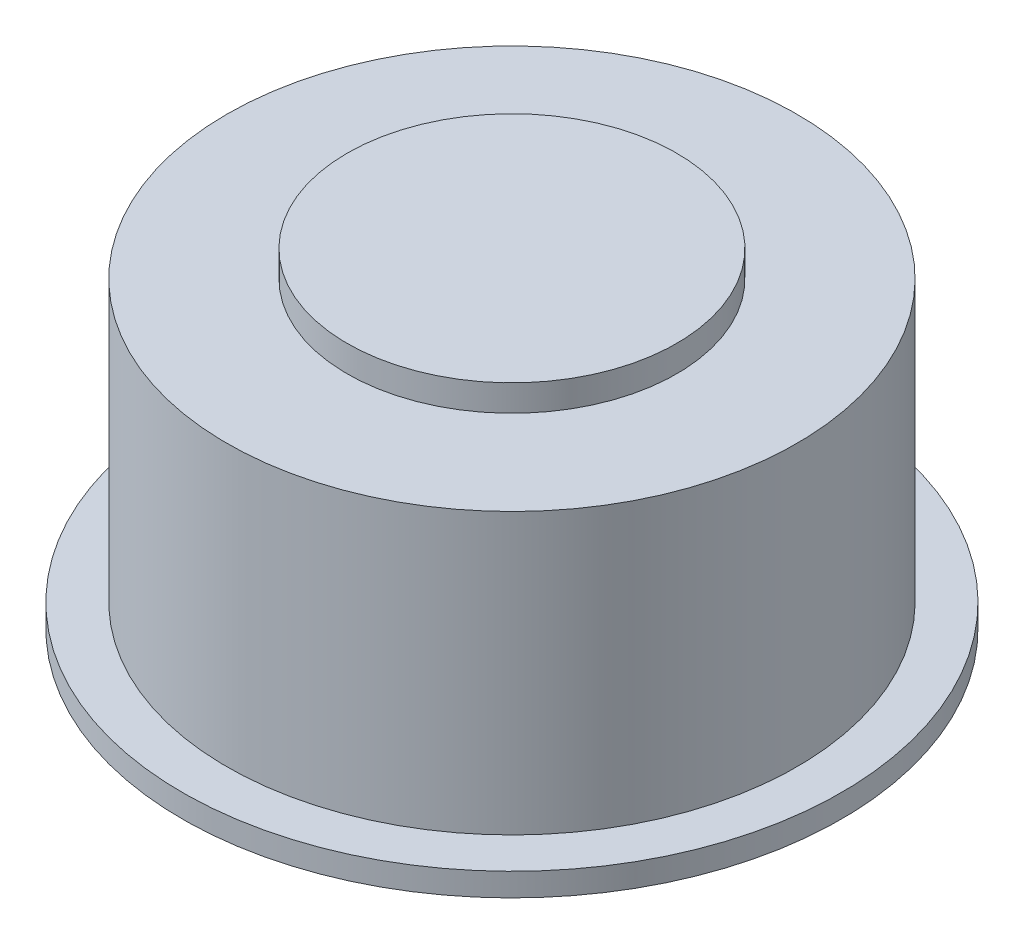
ISO-10303-21;
HEADER;
FILE_DESCRIPTION(('STEP AP214'),'2;1');
FILE_NAME('part.step','',(''),(''),'','','');
FILE_SCHEMA(('AUTOMOTIVE_DESIGN { 1 0 10303 214 1 1 1 1 }'));
ENDSEC;
DATA;
#1=APPLICATION_CONTEXT('core data for automotive mechanical design processes');
#2=APPLICATION_PROTOCOL_DEFINITION('international standard','automotive_design',2000,#1);
#3=PRODUCT_CONTEXT('',#1,'mechanical');
#4=PRODUCT('Part','Part','',(#3));
#5=PRODUCT_RELATED_PRODUCT_CATEGORY('part','',(#4));
#6=PRODUCT_DEFINITION_FORMATION('','',#4);
#7=PRODUCT_DEFINITION_CONTEXT('part definition',#1,'design');
#8=PRODUCT_DEFINITION('design','',#6,#7);
#9=PRODUCT_DEFINITION_SHAPE('','',#8);
#10=(LENGTH_UNIT() NAMED_UNIT(*) SI_UNIT(.MILLI.,.METRE.));
#11=(NAMED_UNIT(*) PLANE_ANGLE_UNIT() SI_UNIT($,.RADIAN.));
#12=(NAMED_UNIT(*) SI_UNIT($,.STERADIAN.) SOLID_ANGLE_UNIT());
#13=UNCERTAINTY_MEASURE_WITH_UNIT(LENGTH_MEASURE(1.E-05),#10,'distance_accuracy_value','');
#14=(GEOMETRIC_REPRESENTATION_CONTEXT(3) GLOBAL_UNCERTAINTY_ASSIGNED_CONTEXT((#13)) GLOBAL_UNIT_ASSIGNED_CONTEXT((#10,
#11,#12)) REPRESENTATION_CONTEXT('',''));
#15=CARTESIAN_POINT('',(0.,0.,0.));
#16=DIRECTION('',(0.,0.,1.));
#17=DIRECTION('',(1.,0.,0.));
#18=AXIS2_PLACEMENT_3D('',#15,#16,#17);
#19=CARTESIAN_POINT('',(0.,0.,0.));
#20=DIRECTION('',(0.,1.,0.));
#21=DIRECTION('',(-1.,0.,0.));
#22=AXIS2_PLACEMENT_3D('',#19,#20,#21);
#23=PLANE('',#22);
#24=CARTESIAN_POINT('',(0.,0.,0.));
#25=DIRECTION('',(0.,1.,0.));
#26=DIRECTION('',(-1.,0.,0.));
#27=AXIS2_PLACEMENT_3D('',#24,#25,#26);
#28=CIRCLE('',#27,100.);
#29=CARTESIAN_POINT('',(-100.,0.,0.));
#30=VERTEX_POINT('',#29);
#31=EDGE_CURVE('E10',#30,#30,#28,.T.);
#32=ORIENTED_EDGE('',*,*,#31,.F.);
#33=EDGE_LOOP('',(#32));
#34=FACE_BOUND('',#33,.T.);
#35=ADVANCED_FACE('F30',(#34),#23,.F.);
#36=CARTESIAN_POINT('',(0.,100.,0.));
#37=DIRECTION('',(0.,1.,0.));
#38=DIRECTION('',(-1.,0.,0.));
#39=AXIS2_PLACEMENT_3D('',#36,#37,#38);
#40=CYLINDRICAL_SURFACE('',#39,100.);
#41=CARTESIAN_POINT('',(0.,7.00000000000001,0.));
#42=DIRECTION('',(0.,1.,0.));
#43=DIRECTION('',(-1.,0.,0.));
#44=AXIS2_PLACEMENT_3D('',#41,#42,#43);
#45=CIRCLE('',#44,100.);
#46=CARTESIAN_POINT('',(-100.,7.00000000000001,0.));
#47=VERTEX_POINT('',#46);
#48=EDGE_CURVE('E36',#47,#47,#45,.T.);
#49=ORIENTED_EDGE('',*,*,#48,.F.);
#50=EDGE_LOOP('',(#49));
#51=FACE_BOUND('',#50,.T.);
#52=ORIENTED_EDGE('',*,*,#31,.T.);
#53=EDGE_LOOP('',(#52));
#54=FACE_BOUND('',#53,.T.);
#55=ADVANCED_FACE('F78',(#51,#54),#40,.T.);
#56=CARTESIAN_POINT('',(100.,7.,0.));
#57=DIRECTION('',(0.,-1.,0.));
#58=DIRECTION('',(1.,0.,0.));
#59=AXIS2_PLACEMENT_3D('',#56,#57,#58);
#60=PLANE('',#59);
#61=CARTESIAN_POINT('',(0.,6.99999999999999,0.));
#62=DIRECTION('',(0.,1.,0.));
#63=DIRECTION('',(-1.,0.,0.));
#64=AXIS2_PLACEMENT_3D('',#61,#62,#63);
#65=CIRCLE('',#64,86.5);
#66=CARTESIAN_POINT('',(-86.5,6.99999999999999,0.));
#67=VERTEX_POINT('',#66);
#68=EDGE_CURVE('E40',#67,#67,#65,.T.);
#69=ORIENTED_EDGE('',*,*,#68,.F.);
#70=EDGE_LOOP('',(#69));
#71=FACE_BOUND('',#70,.T.);
#72=ORIENTED_EDGE('',*,*,#48,.T.);
#73=EDGE_LOOP('',(#72));
#74=FACE_BOUND('',#73,.T.);
#75=ADVANCED_FACE('F73',(#71,#74),#60,.F.);
#76=CARTESIAN_POINT('',(0.,100.,0.));
#77=DIRECTION('',(0.,1.,0.));
#78=DIRECTION('',(-1.,0.,0.));
#79=AXIS2_PLACEMENT_3D('',#76,#77,#78);
#80=CYLINDRICAL_SURFACE('',#79,86.5);
#81=CARTESIAN_POINT('',(0.,92.,0.));
#82=DIRECTION('',(0.,1.,0.));
#83=DIRECTION('',(-1.,0.,0.));
#84=AXIS2_PLACEMENT_3D('',#81,#82,#83);
#85=CIRCLE('',#84,86.5);
#86=CARTESIAN_POINT('',(-86.5,92.,0.));
#87=VERTEX_POINT('',#86);
#88=EDGE_CURVE('E44',#87,#87,#85,.T.);
#89=ORIENTED_EDGE('',*,*,#88,.F.);
#90=EDGE_LOOP('',(#89));
#91=FACE_BOUND('',#90,.T.);
#92=ORIENTED_EDGE('',*,*,#68,.T.);
#93=EDGE_LOOP('',(#92));
#94=FACE_BOUND('',#93,.T.);
#95=ADVANCED_FACE('F67',(#91,#94),#80,.T.);
#96=CARTESIAN_POINT('',(86.5,92.,0.));
#97=DIRECTION('',(0.,-1.,0.));
#98=DIRECTION('',(1.,0.,0.));
#99=AXIS2_PLACEMENT_3D('',#96,#97,#98);
#100=PLANE('',#99);
#101=CARTESIAN_POINT('',(0.,92.,0.));
#102=DIRECTION('',(0.,1.,0.));
#103=DIRECTION('',(-1.,0.,0.));
#104=AXIS2_PLACEMENT_3D('',#101,#102,#103);
#105=CIRCLE('',#104,50.);
#106=CARTESIAN_POINT('',(-50.,92.,0.));
#107=VERTEX_POINT('',#106);
#108=EDGE_CURVE('E49',#107,#107,#105,.T.);
#109=ORIENTED_EDGE('',*,*,#108,.F.);
#110=EDGE_LOOP('',(#109));
#111=FACE_BOUND('',#110,.T.);
#112=ORIENTED_EDGE('',*,*,#88,.T.);
#113=EDGE_LOOP('',(#112));
#114=FACE_BOUND('',#113,.T.);
#115=ADVANCED_FACE('F61',(#111,#114),#100,.F.);
#116=CARTESIAN_POINT('',(0.,100.,0.));
#117=DIRECTION('',(0.,1.,0.));
#118=DIRECTION('',(-1.,0.,0.));
#119=AXIS2_PLACEMENT_3D('',#116,#117,#118);
#120=CYLINDRICAL_SURFACE('',#119,50.);
#121=CARTESIAN_POINT('',(0.,100.,0.));
#122=DIRECTION('',(0.,1.,0.));
#123=DIRECTION('',(-1.,0.,0.));
#124=AXIS2_PLACEMENT_3D('',#121,#122,#123);
#125=CIRCLE('',#124,50.);
#126=CARTESIAN_POINT('',(-50.,100.,0.));
#127=VERTEX_POINT('',#126);
#128=EDGE_CURVE('E52',#127,#127,#125,.T.);
#129=ORIENTED_EDGE('',*,*,#128,.F.);
#130=EDGE_LOOP('',(#129));
#131=FACE_BOUND('',#130,.T.);
#132=ORIENTED_EDGE('',*,*,#108,.T.);
#133=EDGE_LOOP('',(#132));
#134=FACE_BOUND('',#133,.T.);
#135=ADVANCED_FACE('F58',(#131,#134),#120,.T.);
#136=CARTESIAN_POINT('',(50.,100.,0.));
#137=DIRECTION('',(0.,-1.,0.));
#138=DIRECTION('',(1.,0.,0.));
#139=AXIS2_PLACEMENT_3D('',#136,#137,#138);
#140=PLANE('',#139);
#141=ORIENTED_EDGE('',*,*,#128,.T.);
#142=EDGE_LOOP('',(#141));
#143=FACE_BOUND('',#142,.T.);
#144=ADVANCED_FACE('F56',(#143),#140,.F.);
#145=CLOSED_SHELL('',(#35,#55,#75,#95,#115,#135,#144));
#146=MANIFOLD_SOLID_BREP('B2',#145);
#147=ADVANCED_BREP_SHAPE_REPRESENTATION('',(#18,#146),#14);
#148=SHAPE_DEFINITION_REPRESENTATION(#9,#147);
ENDSEC;
END-ISO-10303-21;
